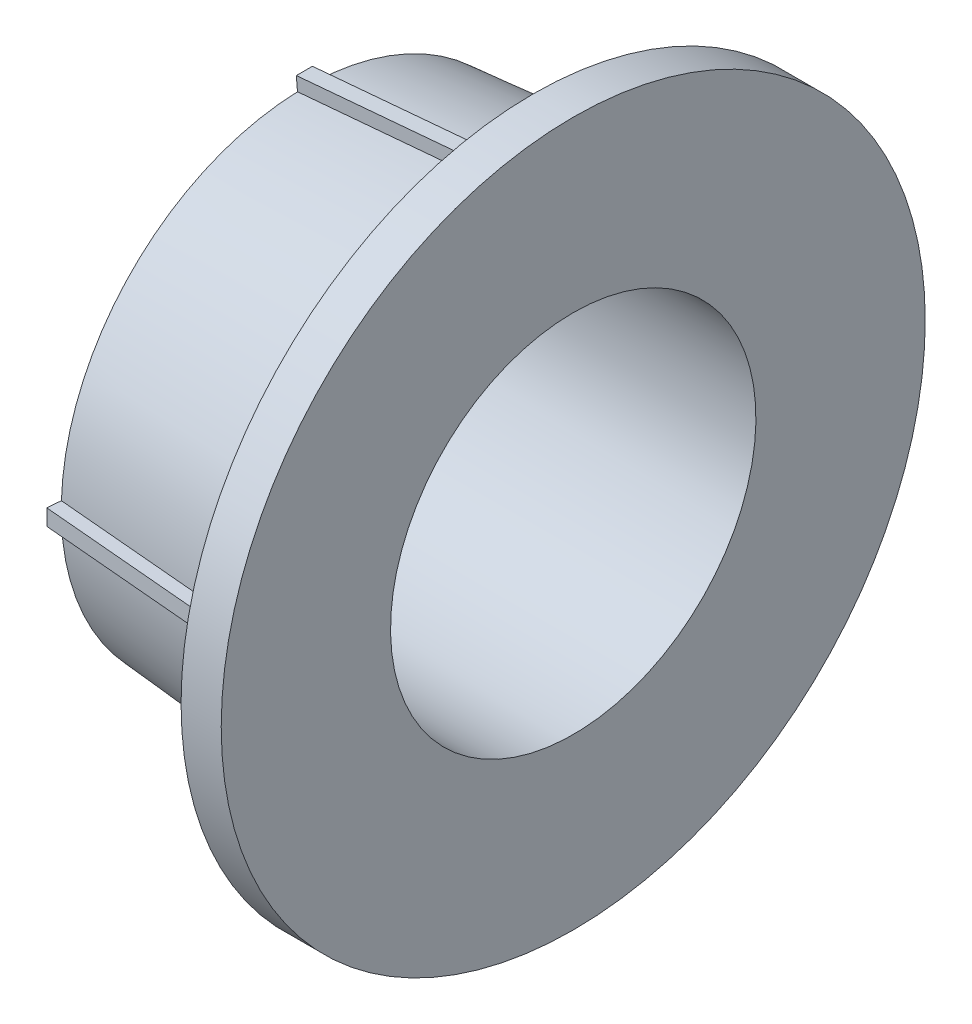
from build123d import *

# Parameters (mm, degrees)
ESQUISSE1_W                  = 3
ESQUISSE1_H                  = 26.3
ESQUISSE2_R                  = 19.7375
BOSS_EXTRU_1_DEPTH           = 17
BOSS_EXTRU_1_TAPER           = 5.000644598
BOSS_EXTRU_2_REACH           = 59.63
ESQUISSE3_W                  = 17.065813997
ESQUISSE3_H                  = 1.2
R_P_TITION_CIRCULAIRE1_COUNT = 4
ESQUISSE9_R                  = 13.65
ENL_V_MAT_EXTRU_1_DEPTH      = 66.039237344


with BuildPart() as part:
    # Esquisse1 → R_volution1 (revolve)
    with BuildSketch(Plane.XY):
        with Locations((18.5, 42.840032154)):
            Rectangle(ESQUISSE1_W, ESQUISSE1_H)
    revolve(axis=Axis((17, 29.690032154, 0), (1, 0, 0)))

    # Esquisse2 → Boss.-Extru.1 (add)
    with BuildSketch(Plane.ZY.offset(-17)):
        with Locations((0, 29.690032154)):
            Circle(ESQUISSE2_R)
    extrude(amount=BOSS_EXTRU_1_DEPTH, taper=BOSS_EXTRU_1_TAPER)

    # Esquisse3 → Boss.-Extru.2 (add, up to next)
    with BuildSketch(Plane(origin=(-4.250047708, 48.571973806, 0), x_dir=(-0.9961937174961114, -0.08716695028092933, 0), z_dir=(-0.08716695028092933, 0.9961937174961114, -2.1035526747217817e-14)), mode=Mode.PRIVATE) as boss_extru_2_sk1:
        with Locations((-12.710833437, 0)):
            Rectangle(ESQUISSE3_W, ESQUISSE3_H)
    boss_extru_2_tool1 = extrude(boss_extru_2_sk1.sketch, amount=-BOSS_EXTRU_2_REACH, mode=Mode.PRIVATE) - part.part
    boss_extru_2 = boss_extru_2_tool1.solids().sort_by_distance((8.412405, 49.679938, 0))[0]
    add(boss_extru_2)

    # R_p_tition circulaire1: Boss.-Extru.2 ×4 about axis
    r_p_tition_circulaire1_axis = Axis((0, 29.690032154, 0), (1, 0, 0))
    for i in range(1, R_P_TITION_CIRCULAIRE1_COUNT):
        add(boss_extru_2.rotate(r_p_tition_circulaire1_axis, i * 360 / R_P_TITION_CIRCULAIRE1_COUNT))

    # Esquisse9 → Enl_v. mat.-Extru.1 (cut, through all)
    with BuildSketch(Plane(origin=(20, 0, 0), x_dir=(0, 0, -1), z_dir=(1, 0, 0))):
        with Locations(Location((0, 29.690032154, 0), (0, 0, 90))):
            Circle(ESQUISSE9_R)
    extrude(amount=-ENL_V_MAT_EXTRU_1_DEPTH, mode=Mode.SUBTRACT)


solid = part.part
